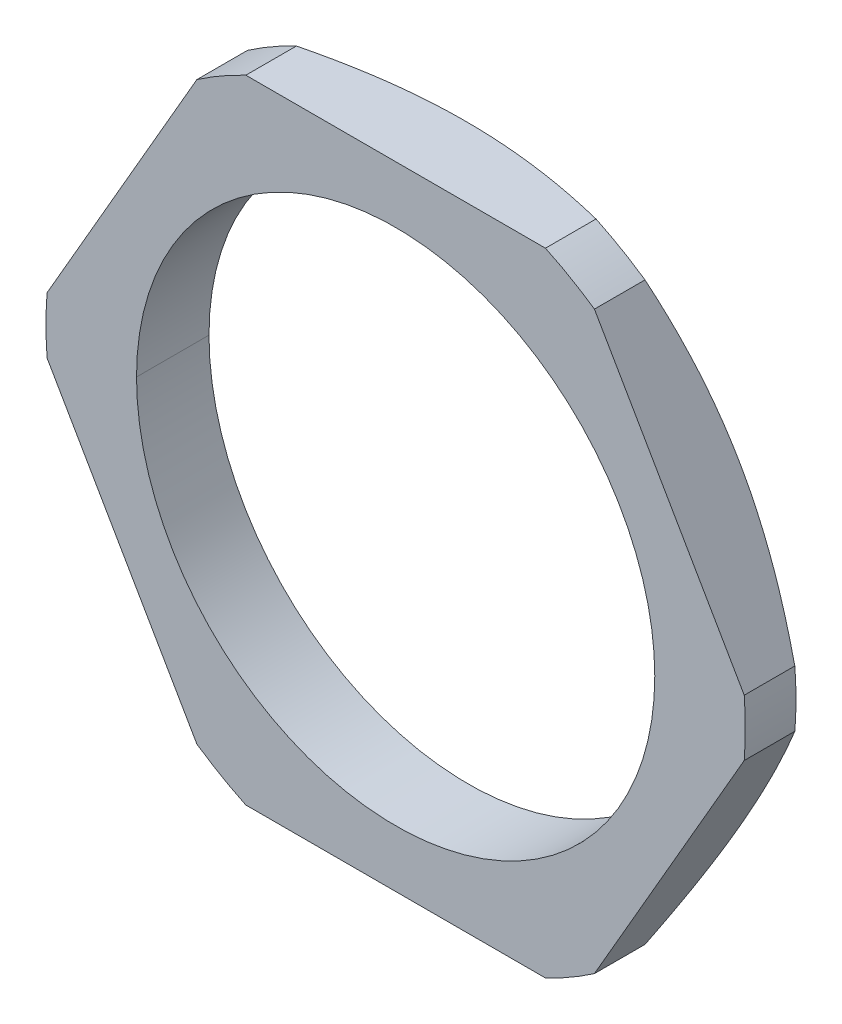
ISO-10303-21;
HEADER;
FILE_DESCRIPTION(('STEP AP214'),'2;1');
FILE_NAME('part.step','',(''),(''),'','','');
FILE_SCHEMA(('AUTOMOTIVE_DESIGN { 1 0 10303 214 1 1 1 1 }'));
ENDSEC;
DATA;
#1=APPLICATION_CONTEXT('core data for automotive mechanical design processes');
#2=APPLICATION_PROTOCOL_DEFINITION('international standard','automotive_design',2000,#1);
#3=PRODUCT_CONTEXT('',#1,'mechanical');
#4=PRODUCT('Part','Part','',(#3));
#5=PRODUCT_RELATED_PRODUCT_CATEGORY('part','',(#4));
#6=PRODUCT_DEFINITION_FORMATION('','',#4);
#7=PRODUCT_DEFINITION_CONTEXT('part definition',#1,'design');
#8=PRODUCT_DEFINITION('design','',#6,#7);
#9=PRODUCT_DEFINITION_SHAPE('','',#8);
#10=(LENGTH_UNIT() NAMED_UNIT(*) SI_UNIT(.MILLI.,.METRE.));
#11=(NAMED_UNIT(*) PLANE_ANGLE_UNIT() SI_UNIT($,.RADIAN.));
#12=(NAMED_UNIT(*) SI_UNIT($,.STERADIAN.) SOLID_ANGLE_UNIT());
#13=UNCERTAINTY_MEASURE_WITH_UNIT(LENGTH_MEASURE(1.E-05),#10,'distance_accuracy_value','');
#14=(GEOMETRIC_REPRESENTATION_CONTEXT(3) GLOBAL_UNCERTAINTY_ASSIGNED_CONTEXT((#13)) GLOBAL_UNIT_ASSIGNED_CONTEXT((#10,
#11,#12)) REPRESENTATION_CONTEXT('',''));
#15=CARTESIAN_POINT('',(0.,0.,0.));
#16=DIRECTION('',(0.,0.,1.));
#17=DIRECTION('',(1.,0.,0.));
#18=AXIS2_PLACEMENT_3D('',#15,#16,#17);
#19=CARTESIAN_POINT('',(0.,0.,-4.09444650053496));
#20=DIRECTION('',(0.,0.,1.));
#21=DIRECTION('',(1.,0.,0.));
#22=AXIS2_PLACEMENT_3D('',#19,#20,#21);
#23=CONICAL_SURFACE('',#22,50.,1.0471975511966);
#24=DIRECTION('',(-0.866025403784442,0.,0.5));
#25=VECTOR('',#24,1.);
#26=CARTESIAN_POINT('',(-50.,1.03267748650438E-13,-4.09444650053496));
#27=LINE('',#26,#25);
#28=CARTESIAN_POINT('',(-37.,0.,-11.6));
#29=VERTEX_POINT('',#28);
#30=CARTESIAN_POINT('',(-41.5,0.,-9.00192378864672));
#31=VERTEX_POINT('',#30);
#32=EDGE_CURVE('E172',#29,#31,#27,.T.);
#33=ORIENTED_EDGE('',*,*,#32,.F.);
#34=CARTESIAN_POINT('',(0.,0.,-11.6));
#35=DIRECTION('',(0.,0.,1.));
#36=DIRECTION('',(1.,0.,0.));
#37=AXIS2_PLACEMENT_3D('',#34,#35,#36);
#38=CIRCLE('',#37,37.);
#39=CARTESIAN_POINT('',(37.,0.,-11.6));
#40=VERTEX_POINT('',#39);
#41=EDGE_CURVE('E166',#29,#40,#38,.T.);
#42=ORIENTED_EDGE('',*,*,#41,.T.);
#43=DIRECTION('',(0.866025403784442,0.,0.5));
#44=VECTOR('',#43,1.);
#45=CARTESIAN_POINT('',(50.,0.,-4.09444650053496));
#46=LINE('',#45,#44);
#47=CARTESIAN_POINT('',(41.5,0.,-9.00192378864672));
#48=VERTEX_POINT('',#47);
#49=EDGE_CURVE('E169',#40,#48,#46,.T.);
#50=ORIENTED_EDGE('',*,*,#49,.T.);
#51=CARTESIAN_POINT('',(0.,0.,-9.00192378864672));
#52=DIRECTION('',(0.,0.,-1.));
#53=DIRECTION('',(1.,0.,0.));
#54=AXIS2_PLACEMENT_3D('',#51,#52,#53);
#55=CIRCLE('',#54,41.5);
#56=CARTESIAN_POINT('',(41.364147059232,-3.35519568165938,-9.00192378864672));
#57=VERTEX_POINT('',#56);
#58=EDGE_CURVE('E290',#48,#57,#55,.T.);
#59=ORIENTED_EDGE('',*,*,#58,.T.);
#60=CARTESIAN_POINT('',(41.3641470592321,-3.35519568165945,-9.00192378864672));
#61=CARTESIAN_POINT('',(41.1157720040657,-3.7853821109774,-9.12477302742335));
#62=CARTESIAN_POINT('',(40.8668456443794,-4.21638213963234,-9.24369856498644));
#63=CARTESIAN_POINT('',(40.3712764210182,-5.07435094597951,-9.47164105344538));
#64=CARTESIAN_POINT('',(40.1246466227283,-5.50129812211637,-9.5807678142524));
#65=CARTESIAN_POINT('',(39.6333250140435,-6.35195708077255,-9.78912016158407));
#66=CARTESIAN_POINT('',(39.388643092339,-6.77565038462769,-9.88844429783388));
#67=CARTESIAN_POINT('',(38.9007922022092,-7.62060726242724,-10.077205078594));
#68=CARTESIAN_POINT('',(38.6576306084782,-8.04185628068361,-10.1667258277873));
#69=CARTESIAN_POINT('',(38.1723234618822,-8.88275493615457,-10.3358911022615));
#70=CARTESIAN_POINT('',(37.9301832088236,-9.30239423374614,-10.4156021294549));
#71=CARTESIAN_POINT('',(37.4463060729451,-10.1408922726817,-10.5651814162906));
#72=CARTESIAN_POINT('',(37.204572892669,-10.5597449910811,-10.6350953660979));
#73=CARTESIAN_POINT('',(36.7155305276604,-11.406881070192,-10.7664920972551));
#74=CARTESIAN_POINT('',(36.4682061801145,-11.8351861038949,-10.8277792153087));
#75=CARTESIAN_POINT('',(35.9744721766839,-12.6903619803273,-10.9394343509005));
#76=CARTESIAN_POINT('',(35.7280656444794,-13.1172265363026,-10.9898642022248));
#77=CARTESIAN_POINT('',(35.2354529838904,-13.9706584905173,-11.0798484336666));
#78=CARTESIAN_POINT('',(34.9892481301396,-14.3972235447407,-11.1194319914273));
#79=CARTESIAN_POINT('',(34.4942954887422,-15.2544984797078,-11.1880253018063));
#80=CARTESIAN_POINT('',(34.2455436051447,-15.6852132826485,-11.2169442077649));
#81=CARTESIAN_POINT('',(33.7487723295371,-16.5454367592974,-11.263365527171));
#82=CARTESIAN_POINT('',(33.5007538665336,-16.9749435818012,-11.2809120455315));
#83=CARTESIAN_POINT('',(33.0047135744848,-17.8341047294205,-11.3046221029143));
#84=CARTESIAN_POINT('',(32.7566917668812,-18.2637589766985,-11.3107889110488));
#85=CARTESIAN_POINT('',(32.2588096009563,-19.1260892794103,-11.3117986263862));
#86=CARTESIAN_POINT('',(32.0089486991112,-19.5587651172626,-11.3065607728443));
#87=CARTESIAN_POINT('',(31.5094621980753,-20.4238057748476,-11.2845597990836));
#88=CARTESIAN_POINT('',(31.2598365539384,-20.8561706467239,-11.2677997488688));
#89=CARTESIAN_POINT('',(30.7600336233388,-21.7219544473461,-11.2227956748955));
#90=CARTESIAN_POINT('',(30.5098573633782,-22.1553719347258,-11.1945126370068));
#91=CARTESIAN_POINT('',(30.0106372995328,-23.0200563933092,-11.1268477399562));
#92=CARTESIAN_POINT('',(29.7615925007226,-23.4513257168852,-11.0875031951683));
#93=CARTESIAN_POINT('',(29.2632442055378,-24.3143981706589,-10.9977134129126));
#94=CARTESIAN_POINT('',(29.0139423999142,-24.7461986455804,-10.9472333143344));
#95=CARTESIAN_POINT('',(28.5143874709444,-25.6115591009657,-10.8352000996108));
#96=CARTESIAN_POINT('',(28.2641385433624,-26.0451125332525,-10.7735778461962));
#97=CARTESIAN_POINT('',(27.7706719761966,-26.899749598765,-10.6416977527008));
#98=CARTESIAN_POINT('',(27.5274398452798,-27.3208657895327,-10.5717044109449));
#99=CARTESIAN_POINT('',(27.0405042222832,-28.1638448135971,-10.4218485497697));
#100=CARTESIAN_POINT('',(26.7968041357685,-28.5857014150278,-10.3419399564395));
#101=CARTESIAN_POINT('',(26.3085098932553,-29.4311232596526,-10.1722662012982));
#102=CARTESIAN_POINT('',(26.063922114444,-29.8546786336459,-10.082433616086));
#103=CARTESIAN_POINT('',(25.5733693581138,-30.7043682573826,-9.89293532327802));
#104=CARTESIAN_POINT('',(25.3274134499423,-31.1304886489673,-9.79318411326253));
#105=CARTESIAN_POINT('',(24.8336248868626,-31.9861014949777,-9.58386448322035));
#106=CARTESIAN_POINT('',(24.5858034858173,-32.4155758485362,-9.47419574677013));
#107=CARTESIAN_POINT('',(24.0877549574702,-33.2786149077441,-9.24505648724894));
#108=CARTESIAN_POINT('',(23.8375402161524,-33.7121570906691,-9.12547411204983));
#109=CARTESIAN_POINT('',(23.5877582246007,-34.1448043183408,-9.00192378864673));
#110=B_SPLINE_CURVE_WITH_KNOTS('',3,(#60,#61,#62,#63,#64,#65,#66,#67,#68,#69,#70,#71,#72,#73,
#74,#75,#76,#77,#78,#79,#80,#81,#82,#83,#84,#85,#86,#87,#88,#89,#90,#91,#92,#93,#94,#95,#96,#97,
#98,#99,#100,#101,#102,#103,#104,#105,#106,#107,#108,#109),.UNSPECIFIED.,.F.,.F.,(4,2,2,2,2,2,2,
2,2,2,2,2,2,2,2,2,2,2,2,2,2,2,2,2,4),(0.,1.535114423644,3.05002468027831,4.54769387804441,
6.03129646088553,7.50421125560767,8.97001038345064,10.4650045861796,11.9512450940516,
13.4334473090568,14.9279989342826,16.4167190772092,17.9050114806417,19.4038773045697,
20.9023439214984,22.4059267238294,23.9044970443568,25.4078271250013,26.9208272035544,
28.3947045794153,29.8757069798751,31.3674744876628,32.8734496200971,34.3968658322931,
35.9407403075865),.UNSPECIFIED.);
#111=CARTESIAN_POINT('',(23.5877582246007,-34.1448043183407,-9.00192378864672));
#112=VERTEX_POINT('',#111);
#113=EDGE_CURVE('E264',#57,#112,#110,.T.);
#114=ORIENTED_EDGE('',*,*,#113,.T.);
#115=CARTESIAN_POINT('',(0.,0.,-9.00192378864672));
#116=DIRECTION('',(0.,0.,-1.));
#117=DIRECTION('',(1.,0.,0.));
#118=AXIS2_PLACEMENT_3D('',#115,#116,#117);
#119=CIRCLE('',#118,41.5);
#120=CARTESIAN_POINT('',(17.7763888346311,-37.5,-9.00192378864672));
#121=VERTEX_POINT('',#120);
#122=EDGE_CURVE('E45',#112,#121,#119,.T.);
#123=ORIENTED_EDGE('',*,*,#122,.T.);
#124=CARTESIAN_POINT('',(17.776388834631,-37.5000000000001,-9.00192378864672));
#125=CARTESIAN_POINT('',(17.2793357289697,-37.4999940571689,-9.12485051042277));
#126=CARTESIAN_POINT('',(16.7813011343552,-37.4999173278,-9.24384860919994));
#127=CARTESIAN_POINT('',(15.7898712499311,-37.4997257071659,-9.47192339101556));
#128=CARTESIAN_POINT('',(15.2965012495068,-37.4996113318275,-9.5811101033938));
#129=CARTESIAN_POINT('',(14.313536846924,-37.4994433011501,-9.7895695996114));
#130=CARTESIAN_POINT('',(13.8239634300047,-37.4993889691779,-9.88894112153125));
#131=CARTESIAN_POINT('',(12.8476800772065,-37.4993763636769,-10.077783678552));
#132=CARTESIAN_POINT('',(12.3609864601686,-37.4994171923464,-10.1673389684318));
#133=CARTESIAN_POINT('',(11.3894932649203,-37.4995778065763,-10.3365614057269));
#134=CARTESIAN_POINT('',(10.9047053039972,-37.4996970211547,-10.4162951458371));
#135=CARTESIAN_POINT('',(9.93600546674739,-37.4998998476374,-10.5659041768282));
#136=CARTESIAN_POINT('',(9.45210066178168,-37.4999836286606,-10.6358252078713));
#137=CARTESIAN_POINT('',(8.46758301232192,-37.5000168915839,-10.7680059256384));
#138=CARTESIAN_POINT('',(7.96692788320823,-37.4999620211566,-10.8299515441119));
#139=CARTESIAN_POINT('',(6.96759325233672,-37.4999102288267,-10.9426348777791));
#140=CARTESIAN_POINT('',(6.46892155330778,-37.4999129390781,-10.9934416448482));
#141=CARTESIAN_POINT('',(5.47215718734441,-37.4999594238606,-11.0838888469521));
#142=CARTESIAN_POINT('',(4.97406768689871,-37.5000030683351,-11.1235641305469));
#143=CARTESIAN_POINT('',(3.97733284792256,-37.4999969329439,-11.1917650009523));
#144=CARTESIAN_POINT('',(3.4786878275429,-37.4999471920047,-11.2202952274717));
#145=CARTESIAN_POINT('',(2.48256324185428,-37.4998987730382,-11.2658784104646));
#146=CARTESIAN_POINT('',(1.98508544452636,-37.4998999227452,-11.2829698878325));
#147=CARTESIAN_POINT('',(0.989741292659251,-37.4999473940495,-11.3057192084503));
#148=CARTESIAN_POINT('',(0.491874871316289,-37.4999937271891,-11.3113741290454));
#149=CARTESIAN_POINT('',(-0.5021148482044,-37.5000062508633,-11.3112752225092));
#150=CARTESIAN_POINT('',(-0.998238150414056,-37.4999727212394,-11.3055612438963));
#151=CARTESIAN_POINT('',(-1.99037580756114,-37.4999796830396,-11.2827510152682));
#152=CARTESIAN_POINT('',(-2.48639008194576,-37.5000201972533,-11.2656512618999));
#153=CARTESIAN_POINT('',(-3.47985562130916,-37.5001295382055,-11.2201189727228));
#154=CARTESIAN_POINT('',(-3.97730484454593,-37.5001984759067,-11.1916420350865));
#155=CARTESIAN_POINT('',(-4.96903948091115,-37.5002012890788,-11.1238038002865));
#156=CARTESIAN_POINT('',(-5.46332855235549,-37.5001358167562,-11.0844958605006));
#157=CARTESIAN_POINT('',(-6.45226062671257,-37.5000310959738,-10.9949781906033));
#158=CARTESIAN_POINT('',(-6.94690099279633,-37.4999919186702,-10.9447393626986));
#159=CARTESIAN_POINT('',(-7.93790343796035,-37.4999883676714,-10.833382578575));
#160=CARTESIAN_POINT('',(-8.43425849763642,-37.5000244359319,-10.772202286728));
#161=CARTESIAN_POINT('',(-9.41655208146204,-37.4999760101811,-10.6408521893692));
#162=CARTESIAN_POINT('',(-9.9025153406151,-37.4998937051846,-10.5708668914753));
#163=CARTESIAN_POINT('',(-10.8753260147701,-37.4996886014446,-10.4210450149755));
#164=CARTESIAN_POINT('',(-11.3621663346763,-37.4995656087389,-10.3411624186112));
#165=CARTESIAN_POINT('',(-12.3377726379,-37.4994009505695,-10.1715544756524));
#166=CARTESIAN_POINT('',(-12.8265269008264,-37.4993598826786,-10.0817618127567));
#167=CARTESIAN_POINT('',(-13.8069540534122,-37.4993737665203,-9.8923581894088));
#168=CARTESIAN_POINT('',(-14.2986104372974,-37.4994296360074,-9.79266190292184));
#169=CARTESIAN_POINT('',(-15.2857762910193,-37.4996020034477,-9.58346660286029));
#170=CARTESIAN_POINT('',(-15.7812645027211,-37.499719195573,-9.47386749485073));
#171=CARTESIAN_POINT('',(-16.7769785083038,-37.4999154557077,-9.24488198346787));
#172=CARTESIAN_POINT('',(-17.2771786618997,-37.4999939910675,-9.12538398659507));
#173=CARTESIAN_POINT('',(-17.7763888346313,-37.5,-9.00192378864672));
#174=B_SPLINE_CURVE_WITH_KNOTS('',3,(#124,#125,#126,#127,#128,#129,#130,#131,#132,#133,#134,
#135,#136,#137,#138,#139,#140,#141,#142,#143,#144,#145,#146,#147,#148,#149,#150,#151,#152,#153,
#154,#155,#156,#157,#158,#159,#160,#161,#162,#163,#164,#165,#166,#167,#168,#169,#170,#171,#172,
#173),.UNSPECIFIED.,.F.,.F.,(4,2,2,2,2,2,2,2,2,2,2,2,2,2,2,2,2,2,2,2,2,2,2,2,4),(0.,
1.53608235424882,3.05193351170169,4.55052250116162,6.03503022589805,7.50884248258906,
8.97553882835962,10.4888434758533,11.9924835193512,13.491362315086,14.9896164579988,
16.4827993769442,17.9763638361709,19.4647025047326,20.9534993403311,22.4481641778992,
23.9355934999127,25.4270318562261,26.9272548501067,28.4000891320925,29.8800482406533,
31.3707635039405,32.8756692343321,34.3979912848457,35.9407398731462),.UNSPECIFIED.);
#175=CARTESIAN_POINT('',(-17.7763888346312,-37.5,-9.00192378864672));
#176=VERTEX_POINT('',#175);
#177=EDGE_CURVE('E259',#121,#176,#174,.T.);
#178=ORIENTED_EDGE('',*,*,#177,.T.);
#179=CARTESIAN_POINT('',(0.,0.,-9.00192378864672));
#180=DIRECTION('',(0.,0.,-1.));
#181=DIRECTION('',(1.,0.,0.));
#182=AXIS2_PLACEMENT_3D('',#179,#180,#181);
#183=CIRCLE('',#182,41.5);
#184=CARTESIAN_POINT('',(-23.5877582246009,-34.1448043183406,-9.00192378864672));
#185=VERTEX_POINT('',#184);
#186=EDGE_CURVE('E253',#176,#185,#183,.T.);
#187=ORIENTED_EDGE('',*,*,#186,.T.);
#188=CARTESIAN_POINT('',(-23.587758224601,-34.1448043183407,-9.00192378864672));
#189=CARTESIAN_POINT('',(-23.8361230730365,-33.714611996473,-9.12477302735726));
#190=CARTESIAN_POINT('',(-24.0849168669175,-33.2835354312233,-9.24369856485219));
#191=CARTESIAN_POINT('',(-24.5801550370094,-32.4253754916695,-9.47164105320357));
#192=CARTESIAN_POINT('',(-24.826587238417,-31.9983142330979,-9.58076781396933));
#193=CARTESIAN_POINT('',(-25.3176187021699,-31.1474877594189,-9.78912016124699));
#194=CARTESIAN_POINT('',(-25.5622069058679,-30.7237403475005,-9.88844429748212));
#195=CARTESIAN_POINT('',(-26.0500355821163,-29.8787706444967,-10.0772050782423));
#196=CARTESIAN_POINT('',(-26.2932671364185,-29.4575620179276,-10.1667258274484));
#197=CARTESIAN_POINT('',(-26.778853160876,-28.6168243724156,-10.3358911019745));
#198=CARTESIAN_POINT('',(-27.0212013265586,-28.1973051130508,-10.415602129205));
#199=CARTESIAN_POINT('',(-27.5054233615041,-27.3590062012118,-10.5651814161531));
#200=CARTESIAN_POINT('',(-27.7472938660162,-26.9402327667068,-10.6350953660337));
#201=CARTESIAN_POINT('',(-28.2364140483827,-26.0931416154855,-10.7664920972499));
#202=CARTESIAN_POINT('',(-28.4836749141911,-25.6647999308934,-10.8277792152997));
#203=CARTESIAN_POINT('',(-28.9774119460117,-24.8096258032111,-10.9394343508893));
#204=CARTESIAN_POINT('',(-29.2238842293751,-24.3827992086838,-10.9898642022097));
#205=CARTESIAN_POINT('',(-29.7166716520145,-23.5294681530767,-11.0798484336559));
#206=CARTESIAN_POINT('',(-29.9629853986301,-23.1029659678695,-11.119431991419));
#207=CARTESIAN_POINT('',(-30.4579309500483,-22.2456869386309,-11.1880253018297));
#208=CARTESIAN_POINT('',(-30.7065649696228,-21.8149040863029,-11.2169442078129));
#209=CARTESIAN_POINT('',(-31.2031547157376,-20.9545758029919,-11.263365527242));
#210=CARTESIAN_POINT('',(-31.451109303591,-20.5250321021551,-11.2809120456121));
#211=CARTESIAN_POINT('',(-31.9471445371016,-19.6658680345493,-11.304622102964));
#212=CARTESIAN_POINT('',(-32.1952251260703,-19.2362477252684,-11.3107889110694));
#213=CARTESIAN_POINT('',(-32.6930839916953,-18.3739039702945,-11.3117986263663));
#214=CARTESIAN_POINT('',(-32.9428618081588,-17.9411801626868,-11.3065607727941));
#215=CARTESIAN_POINT('',(-33.4422657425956,-17.076091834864,-11.2845597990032));
#216=CARTESIAN_POINT('',(-33.6918918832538,-16.6437272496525,-11.267799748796));
#217=CARTESIAN_POINT('',(-34.1917811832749,-15.7779933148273,-11.2227956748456));
#218=CARTESIAN_POINT('',(-34.4420436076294,-15.3446255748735,-11.1945126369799));
#219=CARTESIAN_POINT('',(-34.9412722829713,-14.4799460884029,-11.1268477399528));
#220=CARTESIAN_POINT('',(-35.1902400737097,-14.0486323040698,-11.0875031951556));
#221=CARTESIAN_POINT('',(-35.6885085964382,-13.1855137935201,-10.9977134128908));
#222=CARTESIAN_POINT('',(-35.9378078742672,-12.7537118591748,-10.9472333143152));
#223=CARTESIAN_POINT('',(-36.4374545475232,-11.8884043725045,-10.835200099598));
#224=CARTESIAN_POINT('',(-36.6877983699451,-11.454905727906,-10.7735778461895));
#225=CARTESIAN_POINT('',(-37.1812024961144,-10.6002326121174,-10.6416977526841));
#226=CARTESIAN_POINT('',(-37.4242837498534,-10.179029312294,-10.5717044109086));
#227=CARTESIAN_POINT('',(-37.9108571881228,-9.33584118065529,-10.4218485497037));
#228=CARTESIAN_POINT('',(-38.1543456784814,-8.91386241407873,-10.3419399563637));
#229=CARTESIAN_POINT('',(-38.6423553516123,-8.06827627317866,-10.1722662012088));
#230=CARTESIAN_POINT('',(-38.8868711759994,-7.6446793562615,-10.0824336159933));
#231=CARTESIAN_POINT('',(-39.3774475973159,-6.79500339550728,-9.89293532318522));
#232=CARTESIAN_POINT('',(-39.6235007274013,-6.36893913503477,-9.7931841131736));
#233=CARTESIAN_POINT('',(-40.1175889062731,-5.51349927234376,-9.58386448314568));
#234=CARTESIAN_POINT('',(-40.3656139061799,-5.08414246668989,-9.47419574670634));
#235=CARTESIAN_POINT('',(-40.8640033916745,-4.22130025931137,-9.24505648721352));
#236=CARTESIAN_POINT('',(-41.1143545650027,-3.78783684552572,-9.12547411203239));
#237=CARTESIAN_POINT('',(-41.3641470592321,-3.35519568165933,-9.00192378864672));
#238=B_SPLINE_CURVE_WITH_KNOTS('',3,(#188,#189,#190,#191,#192,#193,#194,#195,#196,#197,#198,
#199,#200,#201,#202,#203,#204,#205,#206,#207,#208,#209,#210,#211,#212,#213,#214,#215,#216,#217,
#218,#219,#220,#221,#222,#223,#224,#225,#226,#227,#228,#229,#230,#231,#232,#233,#234,#235,#236,
#237),.UNSPECIFIED.,.F.,.F.,(4,2,2,2,2,2,2,2,2,2,2,2,2,2,2,2,2,2,2,2,2,2,2,2,4),(0.,
1.53511442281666,3.05002467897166,4.54769387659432,6.0312964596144,7.50421125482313,
8.97001038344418,10.4650045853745,11.9512450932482,13.433447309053,14.9279989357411,
16.4167190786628,17.9050114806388,19.4038773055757,20.9023439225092,22.4059267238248,
23.9044970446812,25.4078271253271,26.9208272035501,28.3947045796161,29.8757069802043,
31.3674744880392,32.8734496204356,34.3968658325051,35.9407403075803),.UNSPECIFIED.);
#239=CARTESIAN_POINT('',(-41.364147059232,-3.35519568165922,-9.00192378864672));
#240=VERTEX_POINT('',#239);
#241=EDGE_CURVE('E248',#185,#240,#238,.T.);
#242=ORIENTED_EDGE('',*,*,#241,.T.);
#243=CARTESIAN_POINT('',(0.,0.,-9.00192378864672));
#244=DIRECTION('',(0.,0.,-1.));
#245=DIRECTION('',(1.,0.,0.));
#246=AXIS2_PLACEMENT_3D('',#243,#244,#245);
#247=CIRCLE('',#246,41.5);
#248=EDGE_CURVE('E525',#240,#31,#247,.T.);
#249=ORIENTED_EDGE('',*,*,#248,.T.);
#250=EDGE_LOOP('',(#33,#42,#50,#59,#114,#123,#178,#187,#242,#249));
#251=FACE_BOUND('',#250,.T.);
#252=ADVANCED_FACE('F15',(#251),#23,.T.);
#253=CARTESIAN_POINT('',(0.,0.,-11.6));
#254=DIRECTION('',(0.,0.,1.));
#255=DIRECTION('',(1.,0.,0.));
#256=AXIS2_PLACEMENT_3D('',#253,#254,#255);
#257=CYLINDRICAL_SURFACE('',#256,30.75);
#258=DIRECTION('',(0.,0.,1.));
#259=VECTOR('',#258,1.);
#260=CARTESIAN_POINT('',(-30.75,0.,-11.6));
#261=LINE('',#260,#259);
#262=CARTESIAN_POINT('',(-30.75,0.,-11.6));
#263=VERTEX_POINT('',#262);
#264=CARTESIAN_POINT('',(-30.75,0.,-3.));
#265=VERTEX_POINT('',#264);
#266=EDGE_CURVE('E208',#263,#265,#261,.T.);
#267=ORIENTED_EDGE('',*,*,#266,.F.);
#268=CARTESIAN_POINT('',(0.,0.,-11.6));
#269=DIRECTION('',(0.,0.,-1.));
#270=DIRECTION('',(-1.,0.,0.));
#271=AXIS2_PLACEMENT_3D('',#268,#269,#270);
#272=CIRCLE('',#271,30.75);
#273=CARTESIAN_POINT('',(30.75,0.,-11.6));
#274=VERTEX_POINT('',#273);
#275=EDGE_CURVE('E177',#263,#274,#272,.T.);
#276=ORIENTED_EDGE('',*,*,#275,.T.);
#277=DIRECTION('',(0.,0.,1.));
#278=VECTOR('',#277,1.);
#279=CARTESIAN_POINT('',(30.75,0.,-11.6));
#280=LINE('',#279,#278);
#281=CARTESIAN_POINT('',(30.75,0.,-3.));
#282=VERTEX_POINT('',#281);
#283=EDGE_CURVE('E178',#274,#282,#280,.T.);
#284=ORIENTED_EDGE('',*,*,#283,.T.);
#285=CARTESIAN_POINT('',(0.,0.,-3.));
#286=DIRECTION('',(0.,0.,-1.));
#287=DIRECTION('',(-1.,0.,0.));
#288=AXIS2_PLACEMENT_3D('',#285,#286,#287);
#289=CIRCLE('',#288,30.75);
#290=EDGE_CURVE('E10',#265,#282,#289,.T.);
#291=ORIENTED_EDGE('',*,*,#290,.F.);
#292=EDGE_LOOP('',(#267,#276,#284,#291));
#293=FACE_BOUND('',#292,.T.);
#294=ADVANCED_FACE('F513',(#293),#257,.F.);
#295=CARTESIAN_POINT('',(0.,0.,-3.));
#296=DIRECTION('',(0.,0.,1.));
#297=DIRECTION('',(1.,0.,0.));
#298=AXIS2_PLACEMENT_3D('',#295,#296,#297);
#299=PLANE('',#298);
#300=CARTESIAN_POINT('',(0.,0.,-3.));
#301=DIRECTION('',(0.,0.,-1.));
#302=DIRECTION('',(-1.,0.,0.));
#303=AXIS2_PLACEMENT_3D('',#300,#301,#302);
#304=CIRCLE('',#303,30.75);
#305=EDGE_CURVE('E212',#282,#265,#304,.T.);
#306=ORIENTED_EDGE('',*,*,#305,.T.);
#307=ORIENTED_EDGE('',*,*,#290,.T.);
#308=EDGE_LOOP('',(#306,#307));
#309=FACE_BOUND('',#308,.T.);
#310=CARTESIAN_POINT('',(0.,0.,-3.));
#311=DIRECTION('',(0.,0.,-1.));
#312=DIRECTION('',(1.,0.,0.));
#313=AXIS2_PLACEMENT_3D('',#310,#311,#312);
#314=CIRCLE('',#313,41.5);
#315=CARTESIAN_POINT('',(-41.364147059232,-3.35519568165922,-3.));
#316=VERTEX_POINT('',#315);
#317=CARTESIAN_POINT('',(-41.364147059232,3.35519568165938,-3.));
#318=VERTEX_POINT('',#317);
#319=EDGE_CURVE('E219',#316,#318,#314,.T.);
#320=ORIENTED_EDGE('',*,*,#319,.F.);
#321=DIRECTION('',(0.5,-0.86602540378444,0.));
#322=VECTOR('',#321,1.);
#323=CARTESIAN_POINT('',(-23.5877582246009,-34.1448043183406,-3.));
#324=LINE('',#323,#322);
#325=CARTESIAN_POINT('',(-23.5877582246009,-34.1448043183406,-3.));
#326=VERTEX_POINT('',#325);
#327=EDGE_CURVE('E249',#316,#326,#324,.T.);
#328=ORIENTED_EDGE('',*,*,#327,.T.);
#329=CARTESIAN_POINT('',(0.,0.,-3.));
#330=DIRECTION('',(0.,0.,1.));
#331=DIRECTION('',(1.,0.,0.));
#332=AXIS2_PLACEMENT_3D('',#329,#330,#331);
#333=CIRCLE('',#332,41.5);
#334=CARTESIAN_POINT('',(-17.7763888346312,-37.5,-3.));
#335=VERTEX_POINT('',#334);
#336=EDGE_CURVE('E255',#326,#335,#333,.T.);
#337=ORIENTED_EDGE('',*,*,#336,.T.);
#338=DIRECTION('',(1.,0.,0.));
#339=VECTOR('',#338,1.);
#340=CARTESIAN_POINT('',(-17.7763888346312,-37.5,-3.));
#341=LINE('',#340,#339);
#342=CARTESIAN_POINT('',(17.7763888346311,-37.5,-3.));
#343=VERTEX_POINT('',#342);
#344=EDGE_CURVE('E261',#335,#343,#341,.T.);
#345=ORIENTED_EDGE('',*,*,#344,.T.);
#346=CARTESIAN_POINT('',(0.,0.,-3.));
#347=DIRECTION('',(0.,0.,-1.));
#348=DIRECTION('',(-1.,0.,0.));
#349=AXIS2_PLACEMENT_3D('',#346,#347,#348);
#350=CIRCLE('',#349,41.5);
#351=CARTESIAN_POINT('',(23.5877582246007,-34.1448043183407,-3.));
#352=VERTEX_POINT('',#351);
#353=EDGE_CURVE('E25',#352,#343,#350,.T.);
#354=ORIENTED_EDGE('',*,*,#353,.F.);
#355=DIRECTION('',(-0.5,-0.866025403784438,0.));
#356=VECTOR('',#355,1.);
#357=CARTESIAN_POINT('',(23.5877582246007,-34.1448043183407,-3.));
#358=LINE('',#357,#356);
#359=CARTESIAN_POINT('',(41.364147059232,-3.35519568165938,-3.));
#360=VERTEX_POINT('',#359);
#361=EDGE_CURVE('E266',#360,#352,#358,.T.);
#362=ORIENTED_EDGE('',*,*,#361,.F.);
#363=CARTESIAN_POINT('',(0.,0.,-3.));
#364=DIRECTION('',(0.,0.,1.));
#365=DIRECTION('',(-1.,0.,0.));
#366=AXIS2_PLACEMENT_3D('',#363,#364,#365);
#367=CIRCLE('',#366,41.5);
#368=CARTESIAN_POINT('',(41.364147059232,3.35519568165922,-3.));
#369=VERTEX_POINT('',#368);
#370=EDGE_CURVE('E240',#360,#369,#367,.T.);
#371=ORIENTED_EDGE('',*,*,#370,.T.);
#372=DIRECTION('',(-0.5,0.86602540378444,0.));
#373=VECTOR('',#372,1.);
#374=CARTESIAN_POINT('',(23.5877582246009,34.1448043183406,-3.));
#375=LINE('',#374,#373);
#376=CARTESIAN_POINT('',(23.5877582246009,34.1448043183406,-3.));
#377=VERTEX_POINT('',#376);
#378=EDGE_CURVE('E199',#369,#377,#375,.T.);
#379=ORIENTED_EDGE('',*,*,#378,.T.);
#380=CARTESIAN_POINT('',(0.,0.,-3.));
#381=DIRECTION('',(0.,0.,1.));
#382=DIRECTION('',(-1.,0.,0.));
#383=AXIS2_PLACEMENT_3D('',#380,#381,#382);
#384=CIRCLE('',#383,41.5);
#385=CARTESIAN_POINT('',(17.7763888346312,37.5,-3.));
#386=VERTEX_POINT('',#385);
#387=EDGE_CURVE('E203',#377,#386,#384,.T.);
#388=ORIENTED_EDGE('',*,*,#387,.T.);
#389=DIRECTION('',(1.,0.,0.));
#390=VECTOR('',#389,1.);
#391=CARTESIAN_POINT('',(-17.7763888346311,37.5,-3.));
#392=LINE('',#391,#390);
#393=CARTESIAN_POINT('',(-17.7763888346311,37.5,-3.));
#394=VERTEX_POINT('',#393);
#395=EDGE_CURVE('E235',#394,#386,#392,.T.);
#396=ORIENTED_EDGE('',*,*,#395,.F.);
#397=CARTESIAN_POINT('',(0.,0.,-3.));
#398=DIRECTION('',(0.,0.,-1.));
#399=DIRECTION('',(1.,0.,0.));
#400=AXIS2_PLACEMENT_3D('',#397,#398,#399);
#401=CIRCLE('',#400,41.5);
#402=CARTESIAN_POINT('',(-23.5877582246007,34.1448043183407,-3.));
#403=VERTEX_POINT('',#402);
#404=EDGE_CURVE('E230',#403,#394,#401,.T.);
#405=ORIENTED_EDGE('',*,*,#404,.F.);
#406=DIRECTION('',(0.5,0.866025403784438,0.));
#407=VECTOR('',#406,1.);
#408=CARTESIAN_POINT('',(-23.5877582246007,34.1448043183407,-3.));
#409=LINE('',#408,#407);
#410=EDGE_CURVE('E225',#318,#403,#409,.T.);
#411=ORIENTED_EDGE('',*,*,#410,.F.);
#412=EDGE_LOOP('',(#320,#328,#337,#345,#354,#362,#371,#379,#388,#396,#405,#411));
#413=FACE_BOUND('',#412,.T.);
#414=ADVANCED_FACE('F344',(#309,#413),#299,.T.);
#415=CARTESIAN_POINT('',(0.,0.,-11.6));
#416=DIRECTION('',(0.,0.,1.));
#417=DIRECTION('',(-1.,0.,0.));
#418=AXIS2_PLACEMENT_3D('',#415,#416,#417);
#419=CYLINDRICAL_SURFACE('',#418,41.5);
#420=ORIENTED_EDGE('',*,*,#122,.F.);
#421=DIRECTION('',(0.,0.,1.));
#422=VECTOR('',#421,1.);
#423=CARTESIAN_POINT('',(23.5877582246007,-34.1448043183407,-11.6));
#424=LINE('',#423,#422);
#425=EDGE_CURVE('E270',#112,#352,#424,.T.);
#426=ORIENTED_EDGE('',*,*,#425,.T.);
#427=ORIENTED_EDGE('',*,*,#353,.T.);
#428=DIRECTION('',(0.,0.,1.));
#429=VECTOR('',#428,1.);
#430=CARTESIAN_POINT('',(17.7763888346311,-37.5,-11.6));
#431=LINE('',#430,#429);
#432=EDGE_CURVE('E265',#121,#343,#431,.T.);
#433=ORIENTED_EDGE('',*,*,#432,.F.);
#434=EDGE_LOOP('',(#420,#426,#427,#433));
#435=FACE_BOUND('',#434,.T.);
#436=ADVANCED_FACE('F303',(#435),#419,.T.);
#437=CARTESIAN_POINT('',(23.5877582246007,-34.1448043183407,-11.6));
#438=DIRECTION('',(-0.866025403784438,0.5,0.));
#439=DIRECTION('',(0.,0.,1.));
#440=AXIS2_PLACEMENT_3D('',#437,#438,#439);
#441=PLANE('',#440);
#442=ORIENTED_EDGE('',*,*,#113,.F.);
#443=DIRECTION('',(0.,0.,1.));
#444=VECTOR('',#443,1.);
#445=CARTESIAN_POINT('',(41.364147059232,-3.35519568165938,-11.6));
#446=LINE('',#445,#444);
#447=EDGE_CURVE('E244',#57,#360,#446,.T.);
#448=ORIENTED_EDGE('',*,*,#447,.T.);
#449=ORIENTED_EDGE('',*,*,#361,.T.);
#450=ORIENTED_EDGE('',*,*,#425,.F.);
#451=EDGE_LOOP('',(#442,#448,#449,#450));
#452=FACE_BOUND('',#451,.T.);
#453=ADVANCED_FACE('F292',(#452),#441,.F.);
#454=CARTESIAN_POINT('',(-17.7763888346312,-37.5,-11.6));
#455=DIRECTION('',(0.,1.,0.));
#456=DIRECTION('',(0.,0.,-1.));
#457=AXIS2_PLACEMENT_3D('',#454,#455,#456);
#458=PLANE('',#457);
#459=ORIENTED_EDGE('',*,*,#177,.F.);
#460=ORIENTED_EDGE('',*,*,#432,.T.);
#461=ORIENTED_EDGE('',*,*,#344,.F.);
#462=DIRECTION('',(0.,0.,1.));
#463=VECTOR('',#462,1.);
#464=CARTESIAN_POINT('',(-17.7763888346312,-37.5,-11.6));
#465=LINE('',#464,#463);
#466=EDGE_CURVE('E260',#176,#335,#465,.T.);
#467=ORIENTED_EDGE('',*,*,#466,.F.);
#468=EDGE_LOOP('',(#459,#460,#461,#467));
#469=FACE_BOUND('',#468,.T.);
#470=ADVANCED_FACE('F302',(#469),#458,.F.);
#471=CARTESIAN_POINT('',(0.,0.,-11.6));
#472=DIRECTION('',(0.,0.,1.));
#473=DIRECTION('',(1.,0.,0.));
#474=AXIS2_PLACEMENT_3D('',#471,#472,#473);
#475=CYLINDRICAL_SURFACE('',#474,41.5);
#476=ORIENTED_EDGE('',*,*,#186,.F.);
#477=ORIENTED_EDGE('',*,*,#466,.T.);
#478=ORIENTED_EDGE('',*,*,#336,.F.);
#479=DIRECTION('',(0.,0.,1.));
#480=VECTOR('',#479,1.);
#481=CARTESIAN_POINT('',(-23.5877582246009,-34.1448043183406,-11.6));
#482=LINE('',#481,#480);
#483=EDGE_CURVE('E254',#185,#326,#482,.T.);
#484=ORIENTED_EDGE('',*,*,#483,.F.);
#485=EDGE_LOOP('',(#476,#477,#478,#484));
#486=FACE_BOUND('',#485,.T.);
#487=ADVANCED_FACE('F449',(#486),#475,.T.);
#488=CARTESIAN_POINT('',(-23.5877582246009,-34.1448043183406,-11.6));
#489=DIRECTION('',(0.86602540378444,0.5,0.));
#490=DIRECTION('',(0.,0.,-1.));
#491=AXIS2_PLACEMENT_3D('',#488,#489,#490);
#492=PLANE('',#491);
#493=ORIENTED_EDGE('',*,*,#241,.F.);
#494=ORIENTED_EDGE('',*,*,#483,.T.);
#495=ORIENTED_EDGE('',*,*,#327,.F.);
#496=DIRECTION('',(0.,0.,1.));
#497=VECTOR('',#496,1.);
#498=CARTESIAN_POINT('',(-41.364147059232,-3.35519568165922,-11.6));
#499=LINE('',#498,#497);
#500=EDGE_CURVE('E224',#240,#316,#499,.T.);
#501=ORIENTED_EDGE('',*,*,#500,.F.);
#502=EDGE_LOOP('',(#493,#494,#495,#501));
#503=FACE_BOUND('',#502,.T.);
#504=ADVANCED_FACE('F444',(#503),#492,.F.);
#505=CARTESIAN_POINT('',(0.,0.,-11.6));
#506=DIRECTION('',(0.,0.,1.));
#507=DIRECTION('',(-1.,0.,0.));
#508=AXIS2_PLACEMENT_3D('',#505,#506,#507);
#509=CYLINDRICAL_SURFACE('',#508,41.5);
#510=CARTESIAN_POINT('',(0.,0.,-9.00192378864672));
#511=DIRECTION('',(0.,0.,-1.));
#512=DIRECTION('',(1.,0.,0.));
#513=AXIS2_PLACEMENT_3D('',#510,#511,#512);
#514=CIRCLE('',#513,41.5);
#515=CARTESIAN_POINT('',(17.7763888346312,37.5,-9.00192378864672));
#516=VERTEX_POINT('',#515);
#517=CARTESIAN_POINT('',(23.5877582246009,34.1448043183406,-9.00192378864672));
#518=VERTEX_POINT('',#517);
#519=EDGE_CURVE('E416',#516,#518,#514,.T.);
#520=ORIENTED_EDGE('',*,*,#519,.F.);
#521=DIRECTION('',(0.,0.,1.));
#522=VECTOR('',#521,1.);
#523=CARTESIAN_POINT('',(17.7763888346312,37.5,-11.6));
#524=LINE('',#523,#522);
#525=EDGE_CURVE('E239',#516,#386,#524,.T.);
#526=ORIENTED_EDGE('',*,*,#525,.T.);
#527=ORIENTED_EDGE('',*,*,#387,.F.);
#528=DIRECTION('',(0.,0.,1.));
#529=VECTOR('',#528,1.);
#530=CARTESIAN_POINT('',(23.5877582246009,34.1448043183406,-11.6));
#531=LINE('',#530,#529);
#532=EDGE_CURVE('E204',#518,#377,#531,.T.);
#533=ORIENTED_EDGE('',*,*,#532,.F.);
#534=EDGE_LOOP('',(#520,#526,#527,#533));
#535=FACE_BOUND('',#534,.T.);
#536=ADVANCED_FACE('F439',(#535),#509,.T.);
#537=CARTESIAN_POINT('',(23.5877582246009,34.1448043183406,-11.6));
#538=DIRECTION('',(-0.86602540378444,-0.5,0.));
#539=DIRECTION('',(0.5,-0.86602540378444,0.));
#540=AXIS2_PLACEMENT_3D('',#537,#538,#539);
#541=PLANE('',#540);
#542=CARTESIAN_POINT('',(23.5877582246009,34.1448043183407,-9.00192378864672));
#543=CARTESIAN_POINT('',(23.8361230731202,33.7146119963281,-9.12477302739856));
#544=CARTESIAN_POINT('',(24.084916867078,33.2835354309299,-9.2436985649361));
#545=CARTESIAN_POINT('',(24.5801550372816,32.4253754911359,-9.47164105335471));
#546=CARTESIAN_POINT('',(24.8265872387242,31.9983142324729,-9.58076781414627));
#547=CARTESIAN_POINT('',(25.3176187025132,31.14748775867,-9.78912016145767));
#548=CARTESIAN_POINT('',(25.5622069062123,30.723740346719,-9.88844429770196));
#549=CARTESIAN_POINT('',(26.0500355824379,29.8787706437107,-10.0772050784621));
#550=CARTESIAN_POINT('',(26.293267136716,29.4575620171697,-10.1667258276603));
#551=CARTESIAN_POINT('',(26.7788531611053,28.6168243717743,-10.3358911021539));
#552=CARTESIAN_POINT('',(27.0212013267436,28.1973051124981,-10.4156021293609));
#553=CARTESIAN_POINT('',(27.5054233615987,27.3590062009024,-10.5651814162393));
#554=CARTESIAN_POINT('',(27.7472938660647,26.9402327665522,-10.6350953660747));
#555=CARTESIAN_POINT('',(28.2364140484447,26.0931416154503,-10.7664920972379));
#556=CARTESIAN_POINT('',(28.483674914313,25.664799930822,-10.8277792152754));
#557=CARTESIAN_POINT('',(28.9774119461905,24.8096258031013,-10.9394343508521));
#558=CARTESIAN_POINT('',(29.2238842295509,24.3827992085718,-10.9898642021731));
#559=CARTESIAN_POINT('',(29.7166716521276,23.5294681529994,-11.0798484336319));
#560=CARTESIAN_POINT('',(29.9629853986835,23.1029659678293,-11.1194319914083));
#561=CARTESIAN_POINT('',(30.4579309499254,22.2456869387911,-11.188025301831));
#562=CARTESIAN_POINT('',(30.7065649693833,21.8149040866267,-11.2169442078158));
#563=CARTESIAN_POINT('',(31.2031547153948,20.9545758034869,-11.2633655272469));
#564=CARTESIAN_POINT('',(31.4511093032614,20.5250321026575,-11.2809120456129));
#565=CARTESIAN_POINT('',(31.9471445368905,19.6658680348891,-11.3046221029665));
#566=CARTESIAN_POINT('',(32.1952251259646,19.2362477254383,-11.3107889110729));
#567=CARTESIAN_POINT('',(32.6930839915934,18.3739039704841,-11.3117986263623));
#568=CARTESIAN_POINT('',(32.9428618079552,17.9411801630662,-11.3065607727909));
#569=CARTESIAN_POINT('',(33.4422657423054,17.0760918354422,-11.2845597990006));
#570=CARTESIAN_POINT('',(33.6918918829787,16.6437272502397,-11.2677997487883));
#571=CARTESIAN_POINT('',(34.1917811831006,15.777993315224,-11.2227956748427));
#572=CARTESIAN_POINT('',(34.4420436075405,15.3446255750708,-11.1945126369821));
#573=CARTESIAN_POINT('',(34.9412722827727,14.4799460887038,-11.1268477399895));
#574=CARTESIAN_POINT('',(35.1902400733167,14.048632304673,-11.0875031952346));
#575=CARTESIAN_POINT('',(35.6885085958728,13.1855137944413,-10.9977134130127));
#576=CARTESIAN_POINT('',(35.9378078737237,12.7537118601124,-10.94723331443));
#577=CARTESIAN_POINT('',(36.4374545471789,11.8884043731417,-10.8352000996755));
#578=CARTESIAN_POINT('',(36.6877983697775,11.4549057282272,-10.7735778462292));
#579=CARTESIAN_POINT('',(37.1812024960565,10.6002326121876,-10.6416977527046));
#580=CARTESIAN_POINT('',(37.4242837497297,10.1790293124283,-10.5717044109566));
#581=CARTESIAN_POINT('',(37.9108571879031,9.33584118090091,-10.4218485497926));
#582=CARTESIAN_POINT('',(38.1543456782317,8.91386241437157,-10.3419399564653));
#583=CARTESIAN_POINT('',(38.6423553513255,8.0682762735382,-10.1722662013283));
#584=CARTESIAN_POINT('',(38.8868711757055,7.64467935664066,-10.0824336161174));
#585=CARTESIAN_POINT('',(39.3774475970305,6.79500339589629,-9.89293532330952));
#586=CARTESIAN_POINT('',(39.6235007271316,6.36893913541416,-9.79318411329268));
#587=CARTESIAN_POINT('',(40.117588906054,5.51349927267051,-9.58386448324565));
#588=CARTESIAN_POINT('',(40.3656139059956,5.08414246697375,-9.47419574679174));
#589=CARTESIAN_POINT('',(40.8640033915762,4.2213002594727,-9.24505648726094));
#590=CARTESIAN_POINT('',(41.1143545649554,3.78783684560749,-9.12547411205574));
#591=CARTESIAN_POINT('',(41.3641470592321,3.35519568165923,-9.00192378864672));
#592=B_SPLINE_CURVE_WITH_KNOTS('',3,(#542,#543,#544,#545,#546,#547,#548,#549,#550,#551,#552,
#553,#554,#555,#556,#557,#558,#559,#560,#561,#562,#563,#564,#565,#566,#567,#568,#569,#570,#571,
#572,#573,#574,#575,#576,#577,#578,#579,#580,#581,#582,#583,#584,#585,#586,#587,#588,#589,#590,
#591),.UNSPECIFIED.,.F.,.F.,(4,2,2,2,2,2,2,2,2,2,2,2,2,2,2,2,2,2,2,2,2,2,2,2,4),(0.,
1.53511442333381,3.05002467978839,4.54769387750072,6.03129646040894,7.50421125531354,
8.97001038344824,10.4650045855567,11.9512450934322,13.4334473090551,14.9279989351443,
16.4167190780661,17.9050114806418,19.4038773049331,20.9023439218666,22.4059267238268,
23.9044970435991,25.4078271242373,26.9208272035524,28.3947045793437,29.8757069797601,
31.3674744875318,32.8734496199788,34.3968658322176,35.940740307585),.UNSPECIFIED.);
#593=CARTESIAN_POINT('',(41.364147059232,3.35519568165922,-9.00192378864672));
#594=VERTEX_POINT('',#593);
#595=EDGE_CURVE('E408',#518,#594,#592,.T.);
#596=ORIENTED_EDGE('',*,*,#595,.F.);
#597=ORIENTED_EDGE('',*,*,#532,.T.);
#598=ORIENTED_EDGE('',*,*,#378,.F.);
#599=DIRECTION('',(0.,0.,1.));
#600=VECTOR('',#599,1.);
#601=CARTESIAN_POINT('',(41.364147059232,3.35519568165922,-11.6));
#602=LINE('',#601,#600);
#603=EDGE_CURVE('E245',#594,#369,#602,.T.);
#604=ORIENTED_EDGE('',*,*,#603,.F.);
#605=EDGE_LOOP('',(#596,#597,#598,#604));
#606=FACE_BOUND('',#605,.T.);
#607=ADVANCED_FACE('F428',(#606),#541,.F.);
#608=CARTESIAN_POINT('',(0.,0.,-11.6));
#609=DIRECTION('',(0.,0.,1.));
#610=DIRECTION('',(-1.,0.,0.));
#611=AXIS2_PLACEMENT_3D('',#608,#609,#610);
#612=CYLINDRICAL_SURFACE('',#611,41.5);
#613=CARTESIAN_POINT('',(0.,0.,-9.00192378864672));
#614=DIRECTION('',(0.,0.,-1.));
#615=DIRECTION('',(1.,0.,0.));
#616=AXIS2_PLACEMENT_3D('',#613,#614,#615);
#617=CIRCLE('',#616,41.5);
#618=EDGE_CURVE('E185',#594,#48,#617,.T.);
#619=ORIENTED_EDGE('',*,*,#618,.F.);
#620=ORIENTED_EDGE('',*,*,#603,.T.);
#621=ORIENTED_EDGE('',*,*,#370,.F.);
#622=ORIENTED_EDGE('',*,*,#447,.F.);
#623=ORIENTED_EDGE('',*,*,#58,.F.);
#624=EDGE_LOOP('',(#619,#620,#621,#622,#623));
#625=FACE_BOUND('',#624,.T.);
#626=ADVANCED_FACE('F438',(#625),#612,.T.);
#627=CARTESIAN_POINT('',(-17.7763888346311,37.5,-11.6));
#628=DIRECTION('',(0.,-1.,0.));
#629=DIRECTION('',(-1.,0.,0.));
#630=AXIS2_PLACEMENT_3D('',#627,#628,#629);
#631=PLANE('',#630);
#632=CARTESIAN_POINT('',(-17.7763888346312,37.5000000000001,-9.00192378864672));
#633=CARTESIAN_POINT('',(-17.2771843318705,37.499993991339,-9.12538258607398));
#634=CARTESIAN_POINT('',(-16.7769898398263,37.4999157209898,-9.24487913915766));
#635=CARTESIAN_POINT('',(-15.7812847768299,37.4997202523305,-9.47386237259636));
#636=CARTESIAN_POINT('',(-15.285799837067,37.4996035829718,-9.58346060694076));
#637=CARTESIAN_POINT('',(-14.2986382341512,37.4994322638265,-9.79265476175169));
#638=CARTESIAN_POINT('',(-13.8069828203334,37.4993769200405,-9.89235073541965));
#639=CARTESIAN_POINT('',(-12.8265554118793,37.4993637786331,-10.0817543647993));
#640=CARTESIAN_POINT('',(-12.3377999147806,37.4994050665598,-10.1715473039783));
#641=CARTESIAN_POINT('',(-11.3621890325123,37.4995697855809,-10.34115633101));
#642=CARTESIAN_POINT('',(-10.8753453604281,37.4996926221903,-10.4210396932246));
#643=CARTESIAN_POINT('',(-9.90252602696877,37.4998961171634,-10.5708640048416));
#644=CARTESIAN_POINT('',(-9.4165574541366,37.4999769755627,-10.6408509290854));
#645=CARTESIAN_POINT('',(-8.43427614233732,37.5000234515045,-10.7722004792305));
#646=CARTESIAN_POINT('',(-7.93793872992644,37.4999869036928,-10.8333790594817));
#647=CARTESIAN_POINT('',(-6.94695382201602,37.4999913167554,-10.9447341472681));
#648=CARTESIAN_POINT('',(-6.45231330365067,37.5000318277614,-10.9949726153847));
#649=CARTESIAN_POINT('',(-5.46336360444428,37.5001371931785,-11.0844922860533));
#650=CARTESIAN_POINT('',(-4.96905702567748,37.5002019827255,-11.1238022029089));
#651=CARTESIAN_POINT('',(-3.97732250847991,37.5001977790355,-11.1916412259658));
#652=CARTESIAN_POINT('',(-3.47989096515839,37.5001281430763,-11.2201177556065));
#653=CARTESIAN_POINT('',(-2.48644306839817,37.5000195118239,-11.265649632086));
#654=CARTESIAN_POINT('',(-1.9904287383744,37.499980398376,-11.2827489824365));
#655=CARTESIAN_POINT('',(-0.998273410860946,37.4999741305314,-11.3055600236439));
#656=CARTESIAN_POINT('',(-0.502132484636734,37.500006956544,-11.3112748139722));
#657=CARTESIAN_POINT('',(0.491857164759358,37.4999930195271,-11.3113745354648));
#658=CARTESIAN_POINT('',(0.989705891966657,37.4999459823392,-11.3057204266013));
#659=CARTESIAN_POINT('',(1.98503230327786,37.4998992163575,-11.2829719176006));
#660=CARTESIAN_POINT('',(2.48251004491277,37.4998994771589,-11.2658800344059));
#661=CARTESIAN_POINT('',(3.47865234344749,37.4999486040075,-11.2202964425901));
#662=CARTESIAN_POINT('',(3.9773151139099,37.4999976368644,-11.1917658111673));
#663=CARTESIAN_POINT('',(4.97405002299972,37.5000023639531,-11.1235657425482));
#664=CARTESIAN_POINT('',(5.47212189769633,37.4999580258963,-11.0838924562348));
#665=CARTESIAN_POINT('',(6.46886851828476,37.4999121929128,-10.9934472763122));
#666=CARTESIAN_POINT('',(6.96754006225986,37.4999108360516,-10.9426401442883));
#667=CARTESIAN_POINT('',(7.96689234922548,37.4999635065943,-10.8299550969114));
#668=CARTESIAN_POINT('',(8.46756524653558,37.5000178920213,-10.7680077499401));
#669=CARTESIAN_POINT('',(9.4520952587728,37.4999826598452,-10.6358264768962));
#670=CARTESIAN_POINT('',(9.93599471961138,37.4998974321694,-10.5659070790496));
#671=CARTESIAN_POINT('',(10.9046858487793,37.4996929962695,-10.4163004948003));
#672=CARTESIAN_POINT('',(11.3894704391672,37.4995736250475,-10.336567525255));
#673=CARTESIAN_POINT('',(12.3609590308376,37.4994130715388,-10.1673461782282));
#674=CARTESIAN_POINT('',(12.8476514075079,37.4993724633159,-10.0777911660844));
#675=CARTESIAN_POINT('',(13.8239345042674,37.4993858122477,-9.88894861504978));
#676=CARTESIAN_POINT('',(14.3135088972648,37.4994406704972,-9.78957677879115));
#677=CARTESIAN_POINT('',(15.2964775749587,37.4996097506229,-9.5811161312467));
#678=CARTESIAN_POINT('',(15.789850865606,37.4997246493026,-9.47192854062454));
#679=CARTESIAN_POINT('',(16.7812897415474,37.4999170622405,-9.24385146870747));
#680=CARTESIAN_POINT('',(17.2793300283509,37.4999940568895,-9.12485191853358));
#681=CARTESIAN_POINT('',(17.7763888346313,37.5,-9.00192378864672));
#682=B_SPLINE_CURVE_WITH_KNOTS('',3,(#632,#633,#634,#635,#636,#637,#638,#639,#640,#641,#642,
#643,#644,#645,#646,#647,#648,#649,#650,#651,#652,#653,#654,#655,#656,#657,#658,#659,#660,#661,
#662,#663,#664,#665,#666,#667,#668,#669,#670,#671,#672,#673,#674,#675,#676,#677,#678,#679,#680,
#681),.UNSPECIFIED.,.F.,.F.,(4,2,2,2,2,2,2,2,2,2,2,2,2,2,2,2,2,2,2,2,2,2,2,2,4),(0.,
1.54273106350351,3.06504296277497,4.56994565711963,6.06066471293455,7.54063412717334,
9.01348488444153,10.5136546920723,12.0050933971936,13.4925755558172,14.9871873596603,
16.4759843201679,17.964375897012,19.4578872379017,20.9510700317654,22.4493774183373,
23.9482030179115,25.4518427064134,26.9652009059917,28.4318806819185,29.9056825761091,
31.3901864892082,32.8887785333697,34.4046398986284,35.9407398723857),.UNSPECIFIED.);
#683=CARTESIAN_POINT('',(-17.7763888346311,37.5,-9.00192378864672));
#684=VERTEX_POINT('',#683);
#685=EDGE_CURVE('E352',#684,#516,#682,.T.);
#686=ORIENTED_EDGE('',*,*,#685,.F.);
#687=DIRECTION('',(0.,0.,1.));
#688=VECTOR('',#687,1.);
#689=CARTESIAN_POINT('',(-17.7763888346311,37.5,-11.6));
#690=LINE('',#689,#688);
#691=EDGE_CURVE('E234',#684,#394,#690,.T.);
#692=ORIENTED_EDGE('',*,*,#691,.T.);
#693=ORIENTED_EDGE('',*,*,#395,.T.);
#694=ORIENTED_EDGE('',*,*,#525,.F.);
#695=EDGE_LOOP('',(#686,#692,#693,#694));
#696=FACE_BOUND('',#695,.T.);
#697=ADVANCED_FACE('F350',(#696),#631,.F.);
#698=CARTESIAN_POINT('',(0.,0.,-11.6));
#699=DIRECTION('',(0.,0.,1.));
#700=DIRECTION('',(1.,0.,0.));
#701=AXIS2_PLACEMENT_3D('',#698,#699,#700);
#702=CYLINDRICAL_SURFACE('',#701,41.5);
#703=CARTESIAN_POINT('',(0.,0.,-9.00192378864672));
#704=DIRECTION('',(0.,0.,-1.));
#705=DIRECTION('',(1.,0.,0.));
#706=AXIS2_PLACEMENT_3D('',#703,#704,#705);
#707=CIRCLE('',#706,41.5);
#708=CARTESIAN_POINT('',(-23.5877582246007,34.1448043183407,-9.00192378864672));
#709=VERTEX_POINT('',#708);
#710=EDGE_CURVE('E341',#709,#684,#707,.T.);
#711=ORIENTED_EDGE('',*,*,#710,.F.);
#712=DIRECTION('',(0.,0.,1.));
#713=VECTOR('',#712,1.);
#714=CARTESIAN_POINT('',(-23.5877582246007,34.1448043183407,-11.6));
#715=LINE('',#714,#713);
#716=EDGE_CURVE('E229',#709,#403,#715,.T.);
#717=ORIENTED_EDGE('',*,*,#716,.T.);
#718=ORIENTED_EDGE('',*,*,#404,.T.);
#719=ORIENTED_EDGE('',*,*,#691,.F.);
#720=EDGE_LOOP('',(#711,#717,#718,#719));
#721=FACE_BOUND('',#720,.T.);
#722=ADVANCED_FACE('F310',(#721),#702,.T.);
#723=CARTESIAN_POINT('',(-23.5877582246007,34.1448043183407,-11.6));
#724=DIRECTION('',(0.866025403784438,-0.5,0.));
#725=DIRECTION('',(0.,0.,1.));
#726=AXIS2_PLACEMENT_3D('',#723,#724,#725);
#727=PLANE('',#726);
#728=CARTESIAN_POINT('',(-41.3641470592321,3.35519568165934,-9.00192378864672));
#729=CARTESIAN_POINT('',(-41.1157720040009,3.7853821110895,-9.12477302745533));
#730=CARTESIAN_POINT('',(-40.8668456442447,4.21638213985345,-9.24369856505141));
#731=CARTESIAN_POINT('',(-40.3712764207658,5.07435094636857,-9.47164105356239));
#732=CARTESIAN_POINT('',(-40.1246466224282,5.50129812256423,-9.58076781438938));
#733=CARTESIAN_POINT('',(-39.6333250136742,6.35195708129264,-9.78912016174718));
#734=CARTESIAN_POINT('',(-39.3886430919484,6.77565038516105,-9.88844429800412));
#735=CARTESIAN_POINT('',(-38.9007922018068,7.62060726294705,-10.0772050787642));
#736=CARTESIAN_POINT('',(-38.6576306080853,8.04185628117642,-10.1667258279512));
#737=CARTESIAN_POINT('',(-38.1723234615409,8.88275493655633,-10.3358911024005));
#738=CARTESIAN_POINT('',(-37.9301832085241,9.30239423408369,-10.4156021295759));
#739=CARTESIAN_POINT('',(-37.4463060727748,10.1408922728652,-10.565181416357));
#740=CARTESIAN_POINT('',(-37.2045728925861,10.5597449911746,-10.6350953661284));
#741=CARTESIAN_POINT('',(-36.7155305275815,11.4068810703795,-10.7664920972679));
#742=CARTESIAN_POINT('',(-36.4682061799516,11.835186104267,-10.8277792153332));
#743=CARTESIAN_POINT('',(-35.9744721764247,12.690361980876,-10.9394343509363));
#744=CARTESIAN_POINT('',(-35.7280656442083,13.1172265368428,-10.9898642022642));
#745=CARTESIAN_POINT('',(-35.2354529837,13.9706584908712,-11.0798484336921));
#746=CARTESIAN_POINT('',(-34.9892481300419,14.3972235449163,-11.1194319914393));
#747=CARTESIAN_POINT('',(-34.4942954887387,15.2544984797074,-11.1880253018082));
#748=CARTESIAN_POINT('',(-34.2455436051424,15.6852132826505,-11.2169442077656));
#749=CARTESIAN_POINT('',(-33.7487723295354,16.5454367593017,-11.2633655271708));
#750=CARTESIAN_POINT('',(-33.5007538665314,16.9749435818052,-11.2809120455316));
#751=CARTESIAN_POINT('',(-33.0047135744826,17.8341047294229,-11.3046221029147));
#752=CARTESIAN_POINT('',(-32.7566917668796,18.2637589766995,-11.3107889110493));
#753=CARTESIAN_POINT('',(-32.2588096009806,19.1260892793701,-11.3117986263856));
#754=CARTESIAN_POINT('',(-32.008948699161,19.5587651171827,-11.3065607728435));
#755=CARTESIAN_POINT('',(-31.509462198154,20.4238057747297,-11.2845597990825));
#756=CARTESIAN_POINT('',(-31.2598365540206,20.8561706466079,-11.2677997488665));
#757=CARTESIAN_POINT('',(-30.760033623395,21.7219544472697,-11.2227956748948));
#758=CARTESIAN_POINT('',(-30.509857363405,22.155371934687,-11.1945126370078));
#759=CARTESIAN_POINT('',(-30.0106372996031,23.0200563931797,-11.1268477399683));
#760=CARTESIAN_POINT('',(-29.7615925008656,23.4513257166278,-11.0875031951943));
#761=CARTESIAN_POINT('',(-29.2632442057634,24.3143981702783,-10.9977134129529));
#762=CARTESIAN_POINT('',(-29.0139424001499,24.7461986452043,-10.9472333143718));
#763=CARTESIAN_POINT('',(-28.5143874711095,25.6115591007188,-10.8352000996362));
#764=CARTESIAN_POINT('',(-28.2641385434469,26.0451125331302,-10.7735778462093));
#765=CARTESIAN_POINT('',(-27.7706719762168,26.8997495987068,-10.6416977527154));
#766=CARTESIAN_POINT('',(-27.5274398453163,27.3208657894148,-10.5717044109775));
#767=CARTESIAN_POINT('',(-27.0405042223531,28.1638448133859,-10.4218485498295));
#768=CARTESIAN_POINT('',(-26.7968041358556,28.585701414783,-10.341939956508));
#769=CARTESIAN_POINT('',(-26.3085098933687,29.4311232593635,-10.1722662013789));
#770=CARTESIAN_POINT('',(-26.0639221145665,29.854678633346,-10.0824336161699));
#771=CARTESIAN_POINT('',(-25.573369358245,30.7043682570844,-9.89293532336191));
#772=CARTESIAN_POINT('',(-25.3274134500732,31.1304886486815,-9.7931841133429));
#773=CARTESIAN_POINT('',(-24.8336248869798,31.9861014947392,-9.58386448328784));
#774=CARTESIAN_POINT('',(-24.5858034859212,32.4155758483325,-9.47419574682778));
#775=CARTESIAN_POINT('',(-24.0877549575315,33.2786149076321,-9.24505648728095));
#776=CARTESIAN_POINT('',(-23.8375402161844,33.7121570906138,-9.12547411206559));
#777=CARTESIAN_POINT('',(-23.5877582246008,34.1448043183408,-9.00192378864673));
#778=B_SPLINE_CURVE_WITH_KNOTS('',3,(#728,#729,#730,#731,#732,#733,#734,#735,#736,#737,#738,
#739,#740,#741,#742,#743,#744,#745,#746,#747,#748,#749,#750,#751,#752,#753,#754,#755,#756,#757,
#758,#759,#760,#761,#762,#763,#764,#765,#766,#767,#768,#769,#770,#771,#772,#773,#774,#775,#776,
#777),.UNSPECIFIED.,.F.,.F.,(4,2,2,2,2,2,2,2,2,2,2,2,2,2,2,2,2,2,2,2,2,2,2,2,4),(0.,
1.53511442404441,3.05002468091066,4.54769387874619,6.03129646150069,7.50421125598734,
8.97001038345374,10.4650045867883,11.9512450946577,13.4334473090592,14.9279989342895,
16.4167190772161,17.9050114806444,19.4038773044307,20.9023439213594,22.4059267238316,
23.9044970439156,25.4078271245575,26.9208272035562,28.3947045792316,29.8757069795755,
31.3674744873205,32.8734496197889,34.3968658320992,35.9407403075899),.UNSPECIFIED.);
#779=CARTESIAN_POINT('',(-41.364147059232,3.35519568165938,-9.00192378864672));
#780=VERTEX_POINT('',#779);
#781=EDGE_CURVE('E333',#780,#709,#778,.T.);
#782=ORIENTED_EDGE('',*,*,#781,.F.);
#783=DIRECTION('',(0.,0.,1.));
#784=VECTOR('',#783,1.);
#785=CARTESIAN_POINT('',(-41.364147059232,3.35519568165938,-11.6));
#786=LINE('',#785,#784);
#787=EDGE_CURVE('E223',#780,#318,#786,.T.);
#788=ORIENTED_EDGE('',*,*,#787,.T.);
#789=ORIENTED_EDGE('',*,*,#410,.T.);
#790=ORIENTED_EDGE('',*,*,#716,.F.);
#791=EDGE_LOOP('',(#782,#788,#789,#790));
#792=FACE_BOUND('',#791,.T.);
#793=ADVANCED_FACE('F306',(#792),#727,.F.);
#794=CARTESIAN_POINT('',(0.,0.,-11.6));
#795=DIRECTION('',(0.,0.,1.));
#796=DIRECTION('',(1.,0.,0.));
#797=AXIS2_PLACEMENT_3D('',#794,#795,#796);
#798=CYLINDRICAL_SURFACE('',#797,41.5);
#799=ORIENTED_EDGE('',*,*,#248,.F.);
#800=ORIENTED_EDGE('',*,*,#500,.T.);
#801=ORIENTED_EDGE('',*,*,#319,.T.);
#802=ORIENTED_EDGE('',*,*,#787,.F.);
#803=CARTESIAN_POINT('',(0.,0.,-9.00192378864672));
#804=DIRECTION('',(0.,0.,-1.));
#805=DIRECTION('',(1.,0.,0.));
#806=AXIS2_PLACEMENT_3D('',#803,#804,#805);
#807=CIRCLE('',#806,41.5);
#808=EDGE_CURVE('E195',#31,#780,#807,.T.);
#809=ORIENTED_EDGE('',*,*,#808,.F.);
#810=EDGE_LOOP('',(#799,#800,#801,#802,#809));
#811=FACE_BOUND('',#810,.T.);
#812=ADVANCED_FACE('F304',(#811),#798,.T.);
#813=CARTESIAN_POINT('',(0.,0.,-11.6));
#814=DIRECTION('',(0.,0.,1.));
#815=DIRECTION('',(1.,0.,0.));
#816=AXIS2_PLACEMENT_3D('',#813,#814,#815);
#817=PLANE('',#816);
#818=CARTESIAN_POINT('',(0.,0.,-11.6));
#819=DIRECTION('',(0.,0.,-1.));
#820=DIRECTION('',(-1.,0.,0.));
#821=AXIS2_PLACEMENT_3D('',#818,#819,#820);
#822=CIRCLE('',#821,30.75);
#823=EDGE_CURVE('E187',#274,#263,#822,.T.);
#824=ORIENTED_EDGE('',*,*,#823,.F.);
#825=ORIENTED_EDGE('',*,*,#275,.F.);
#826=EDGE_LOOP('',(#824,#825));
#827=FACE_BOUND('',#826,.T.);
#828=CARTESIAN_POINT('',(0.,0.,-11.6));
#829=DIRECTION('',(0.,0.,1.));
#830=DIRECTION('',(1.,0.,0.));
#831=AXIS2_PLACEMENT_3D('',#828,#829,#830);
#832=CIRCLE('',#831,37.);
#833=EDGE_CURVE('E182',#40,#29,#832,.T.);
#834=ORIENTED_EDGE('',*,*,#833,.F.);
#835=ORIENTED_EDGE('',*,*,#41,.F.);
#836=EDGE_LOOP('',(#834,#835));
#837=FACE_BOUND('',#836,.T.);
#838=ADVANCED_FACE('F189',(#827,#837),#817,.F.);
#839=CARTESIAN_POINT('',(0.,0.,-11.6));
#840=DIRECTION('',(0.,0.,1.));
#841=DIRECTION('',(1.,0.,0.));
#842=AXIS2_PLACEMENT_3D('',#839,#840,#841);
#843=CYLINDRICAL_SURFACE('',#842,30.75);
#844=ORIENTED_EDGE('',*,*,#823,.T.);
#845=ORIENTED_EDGE('',*,*,#266,.T.);
#846=ORIENTED_EDGE('',*,*,#305,.F.);
#847=ORIENTED_EDGE('',*,*,#283,.F.);
#848=EDGE_LOOP('',(#844,#845,#846,#847));
#849=FACE_BOUND('',#848,.T.);
#850=ADVANCED_FACE('F384',(#849),#843,.F.);
#851=CARTESIAN_POINT('',(0.,0.,-4.09444650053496));
#852=DIRECTION('',(0.,0.,1.));
#853=DIRECTION('',(1.,0.,0.));
#854=AXIS2_PLACEMENT_3D('',#851,#852,#853);
#855=CONICAL_SURFACE('',#854,50.,1.0471975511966);
#856=ORIENTED_EDGE('',*,*,#833,.T.);
#857=ORIENTED_EDGE('',*,*,#32,.T.);
#858=ORIENTED_EDGE('',*,*,#808,.T.);
#859=ORIENTED_EDGE('',*,*,#781,.T.);
#860=ORIENTED_EDGE('',*,*,#710,.T.);
#861=ORIENTED_EDGE('',*,*,#685,.T.);
#862=ORIENTED_EDGE('',*,*,#519,.T.);
#863=ORIENTED_EDGE('',*,*,#595,.T.);
#864=ORIENTED_EDGE('',*,*,#618,.T.);
#865=ORIENTED_EDGE('',*,*,#49,.F.);
#866=EDGE_LOOP('',(#856,#857,#858,#859,#860,#861,#862,#863,#864,#865));
#867=FACE_BOUND('',#866,.T.);
#868=ADVANCED_FACE('F181',(#867),#855,.T.);
#869=CLOSED_SHELL('',(#252,#294,#414,#436,#453,#470,#487,#504,#536,#607,#626,#697,#722,#793,
#812,#838,#850,#868));
#870=MANIFOLD_SOLID_BREP('B1',#869);
#871=ADVANCED_BREP_SHAPE_REPRESENTATION('',(#18,#870),#14);
#872=SHAPE_DEFINITION_REPRESENTATION(#9,#871);
ENDSEC;
END-ISO-10303-21;
